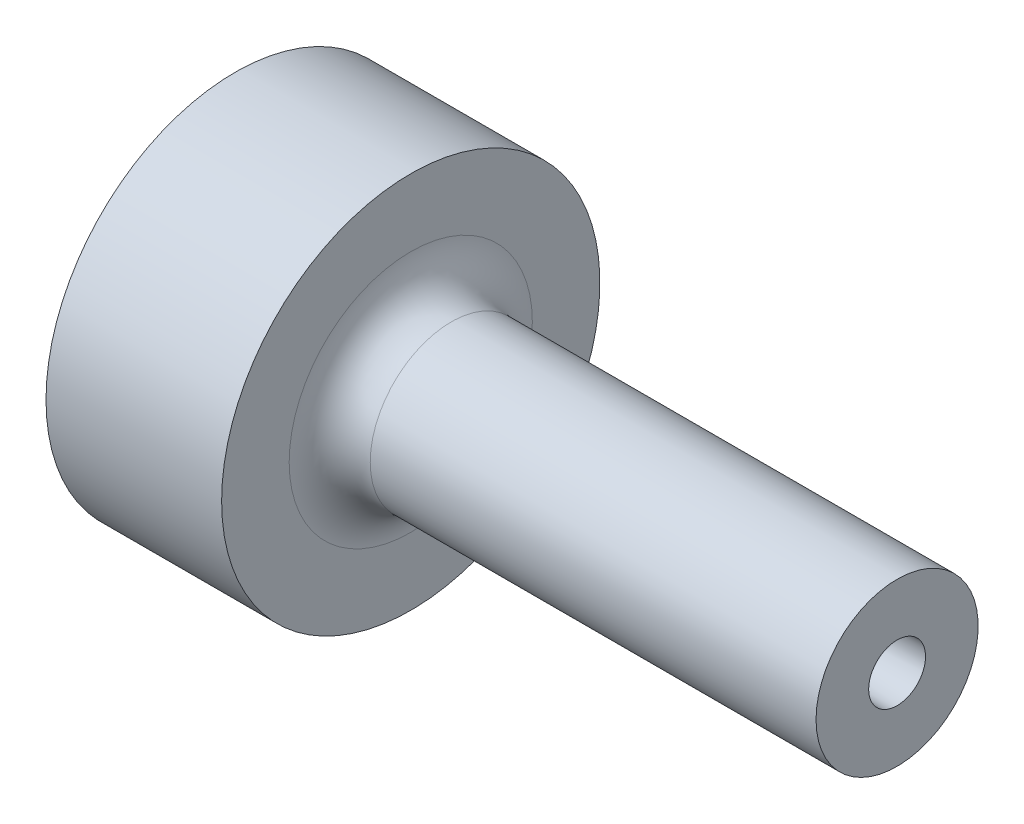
ISO-10303-21;
HEADER;
FILE_DESCRIPTION(('STEP AP214'),'2;1');
FILE_NAME('part.step','',(''),(''),'','','');
FILE_SCHEMA(('AUTOMOTIVE_DESIGN { 1 0 10303 214 1 1 1 1 }'));
ENDSEC;
DATA;
#1=APPLICATION_CONTEXT('core data for automotive mechanical design processes');
#2=APPLICATION_PROTOCOL_DEFINITION('international standard','automotive_design',2000,#1);
#3=PRODUCT_CONTEXT('',#1,'mechanical');
#4=PRODUCT('Part','Part','',(#3));
#5=PRODUCT_RELATED_PRODUCT_CATEGORY('part','',(#4));
#6=PRODUCT_DEFINITION_FORMATION('','',#4);
#7=PRODUCT_DEFINITION_CONTEXT('part definition',#1,'design');
#8=PRODUCT_DEFINITION('design','',#6,#7);
#9=PRODUCT_DEFINITION_SHAPE('','',#8);
#10=(LENGTH_UNIT() NAMED_UNIT(*) SI_UNIT(.MILLI.,.METRE.));
#11=(NAMED_UNIT(*) PLANE_ANGLE_UNIT() SI_UNIT($,.RADIAN.));
#12=(NAMED_UNIT(*) SI_UNIT($,.STERADIAN.) SOLID_ANGLE_UNIT());
#13=UNCERTAINTY_MEASURE_WITH_UNIT(LENGTH_MEASURE(1.E-05),#10,'distance_accuracy_value','');
#14=(GEOMETRIC_REPRESENTATION_CONTEXT(3) GLOBAL_UNCERTAINTY_ASSIGNED_CONTEXT((#13)) GLOBAL_UNIT_ASSIGNED_CONTEXT((#10,
#11,#12)) REPRESENTATION_CONTEXT('',''));
#15=CARTESIAN_POINT('',(0.,0.,0.));
#16=DIRECTION('',(0.,0.,1.));
#17=DIRECTION('',(1.,0.,0.));
#18=AXIS2_PLACEMENT_3D('',#15,#16,#17);
#19=CARTESIAN_POINT('',(0.,0.,0.));
#20=DIRECTION('',(-1.,0.,0.));
#21=DIRECTION('',(0.,0.,1.));
#22=AXIS2_PLACEMENT_3D('',#19,#20,#21);
#23=CYLINDRICAL_SURFACE('',#22,14.);
#24=CARTESIAN_POINT('',(13.,0.,0.));
#25=DIRECTION('',(-1.,0.,0.));
#26=DIRECTION('',(0.,0.,1.));
#27=AXIS2_PLACEMENT_3D('',#24,#25,#26);
#28=CIRCLE('',#27,14.);
#29=CARTESIAN_POINT('',(13.,0.,14.));
#30=VERTEX_POINT('',#29);
#31=EDGE_CURVE('E88',#30,#30,#28,.T.);
#32=ORIENTED_EDGE('',*,*,#31,.T.);
#33=EDGE_LOOP('',(#32));
#34=FACE_BOUND('',#33,.T.);
#35=CARTESIAN_POINT('',(0.,0.,0.));
#36=DIRECTION('',(-1.,0.,0.));
#37=DIRECTION('',(0.,0.,1.));
#38=AXIS2_PLACEMENT_3D('',#35,#36,#37);
#39=CIRCLE('',#38,14.);
#40=CARTESIAN_POINT('',(0.,0.,14.));
#41=VERTEX_POINT('',#40);
#42=EDGE_CURVE('E83',#41,#41,#39,.T.);
#43=ORIENTED_EDGE('',*,*,#42,.F.);
#44=EDGE_LOOP('',(#43));
#45=FACE_BOUND('',#44,.T.);
#46=CARTESIAN_POINT('',(6.5,-13.856406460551,-2.));
#47=CARTESIAN_POINT('',(6.61172417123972,-13.8564082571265,-1.99999534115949));
#48=CARTESIAN_POINT('',(6.72351471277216,-13.8577723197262,-1.99060664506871));
#49=CARTESIAN_POINT('',(6.9439746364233,-13.8630779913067,-1.95330740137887));
#50=CARTESIAN_POINT('',(7.05264079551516,-13.8670221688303,-1.92537839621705));
#51=CARTESIAN_POINT('',(7.26362870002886,-13.8770324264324,-1.85184738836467));
#52=CARTESIAN_POINT('',(7.36595507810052,-13.8830969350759,-1.80625847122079));
#53=CARTESIAN_POINT('',(7.56148972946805,-13.8966626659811,-1.69873175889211));
#54=CARTESIAN_POINT('',(7.65469934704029,-13.9041636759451,-1.63679637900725));
#55=CARTESIAN_POINT('',(7.83004829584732,-13.9198182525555,-1.49785346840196));
#56=CARTESIAN_POINT('',(7.91211171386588,-13.9279757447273,-1.42075056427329));
#57=CARTESIAN_POINT('',(8.06218155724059,-13.9439890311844,-1.25386707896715));
#58=CARTESIAN_POINT('',(8.13018723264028,-13.9518448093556,-1.16408582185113));
#59=CARTESIAN_POINT('',(8.25048909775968,-13.9664103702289,-0.973910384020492));
#60=CARTESIAN_POINT('',(8.30271571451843,-13.9731150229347,-0.873471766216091));
#61=CARTESIAN_POINT('',(8.38953073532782,-13.9845795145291,-0.665136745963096));
#62=CARTESIAN_POINT('',(8.4241199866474,-13.9893394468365,-0.557240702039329));
#63=CARTESIAN_POINT('',(8.47444920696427,-13.9963505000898,-0.337834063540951));
#64=CARTESIAN_POINT('',(8.49031606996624,-13.9986185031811,-0.226353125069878));
#65=CARTESIAN_POINT('',(8.5031438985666,-14.0004479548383,-0.00228956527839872));
#66=CARTESIAN_POINT('',(8.50010582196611,-14.0000095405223,0.110292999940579));
#67=CARTESIAN_POINT('',(8.47531062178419,-13.9964890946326,0.33249899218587));
#68=CARTESIAN_POINT('',(8.45369000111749,-13.9934263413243,0.442137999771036));
#69=CARTESIAN_POINT('',(8.39255744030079,-13.9850228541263,0.656215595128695));
#70=CARTESIAN_POINT('',(8.3530450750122,-13.9796820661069,0.760654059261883));
#71=CARTESIAN_POINT('',(8.25710925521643,-13.9672894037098,0.961781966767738));
#72=CARTESIAN_POINT('',(8.20062784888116,-13.9602316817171,1.05844339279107));
#73=CARTESIAN_POINT('',(8.07239950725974,-13.9451926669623,1.24096782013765));
#74=CARTESIAN_POINT('',(8.00065165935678,-13.9372113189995,1.32683017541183));
#75=CARTESIAN_POINT('',(7.843165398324,-13.921132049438,1.48612299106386));
#76=CARTESIAN_POINT('',(7.75730786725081,-13.9130337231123,1.55943569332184));
#77=CARTESIAN_POINT('',(7.57444547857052,-13.8977029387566,1.69062989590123));
#78=CARTESIAN_POINT('',(7.47744056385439,-13.890470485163,1.74851131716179));
#79=CARTESIAN_POINT('',(7.27491971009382,-13.8776905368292,1.84721301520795));
#80=CARTESIAN_POINT('',(7.1693981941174,-13.8721441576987,1.88802200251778));
#81=CARTESIAN_POINT('',(6.95290242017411,-13.8633846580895,1.9513062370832));
#82=CARTESIAN_POINT('',(6.84192850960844,-13.8601713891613,1.97378265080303));
#83=CARTESIAN_POINT('',(6.61872346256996,-13.8564698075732,1.99960390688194));
#84=CARTESIAN_POINT('',(6.50651197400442,-13.8559577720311,2.00311531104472));
#85=CARTESIAN_POINT('',(6.28310219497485,-13.8576537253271,1.9913480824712));
#86=CARTESIAN_POINT('',(6.17190387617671,-13.8598616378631,1.9760699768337));
#87=CARTESIAN_POINT('',(5.95418781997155,-13.8667269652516,1.92729837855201));
#88=CARTESIAN_POINT('',(5.84765127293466,-13.8713733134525,1.8938871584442));
#89=CARTESIAN_POINT('',(5.6416912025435,-13.8825829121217,1.80988306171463));
#90=CARTESIAN_POINT('',(5.54226800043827,-13.8891462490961,1.75928940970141));
#91=CARTESIAN_POINT('',(5.35260812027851,-13.9035064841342,1.64195360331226));
#92=CARTESIAN_POINT('',(5.26243903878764,-13.911311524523,1.57510320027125));
#93=CARTESIAN_POINT('',(5.09454027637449,-13.9272509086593,1.42730277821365));
#94=CARTESIAN_POINT('',(5.01681123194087,-13.9353852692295,1.34635203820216));
#95=CARTESIAN_POINT('',(4.8754047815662,-13.9511405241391,1.17191708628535));
#96=CARTESIAN_POINT('',(4.81183747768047,-13.9587570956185,1.07834317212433));
#97=CARTESIAN_POINT('',(4.70132443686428,-13.972552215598,0.881748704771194));
#98=CARTESIAN_POINT('',(4.65437828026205,-13.9787308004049,0.778728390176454));
#99=CARTESIAN_POINT('',(4.57861788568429,-13.9889347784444,0.566515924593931));
#100=CARTESIAN_POINT('',(4.54974241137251,-13.9929674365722,0.457345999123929));
#101=CARTESIAN_POINT('',(4.51074453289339,-13.9984555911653,0.235645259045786));
#102=CARTESIAN_POINT('',(4.50062101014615,-13.9999112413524,0.123114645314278));
#103=CARTESIAN_POINT('',(4.49943976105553,-14.0000800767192,-0.101043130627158));
#104=CARTESIAN_POINT('',(4.50821318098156,-13.998817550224,-0.212669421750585));
#105=CARTESIAN_POINT('',(4.54421615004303,-13.9937406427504,-0.432842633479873));
#106=CARTESIAN_POINT('',(4.57144565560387,-13.989926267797,-0.541389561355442));
#107=CARTESIAN_POINT('',(4.6435299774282,-13.9801722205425,-0.752283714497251));
#108=CARTESIAN_POINT('',(4.68837418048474,-13.9742338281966,-0.854634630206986));
#109=CARTESIAN_POINT('',(4.79439714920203,-13.960885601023,-1.05038570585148));
#110=CARTESIAN_POINT('',(4.8555763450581,-13.9534757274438,-1.14378562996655));
#111=CARTESIAN_POINT('',(4.99314771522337,-13.9379304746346,-1.31984194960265));
#112=CARTESIAN_POINT('',(5.06966490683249,-13.9297894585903,-1.40240016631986));
#113=CARTESIAN_POINT('',(5.2354775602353,-13.9137422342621,-1.55356716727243));
#114=CARTESIAN_POINT('',(5.32477602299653,-13.9058360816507,-1.6221726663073));
#115=CARTESIAN_POINT('',(5.51414543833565,-13.8911108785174,-1.74379523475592));
#116=CARTESIAN_POINT('',(5.61426869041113,-13.8842975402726,-1.79673154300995));
#117=CARTESIAN_POINT('',(5.82203229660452,-13.8725962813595,-1.88495902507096));
#118=CARTESIAN_POINT('',(5.92966459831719,-13.8677063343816,-1.92026877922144));
#119=CARTESIAN_POINT('',(6.11483642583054,-13.8615529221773,-1.96409255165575));
#120=CARTESIAN_POINT('',(6.19122433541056,-13.859633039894,-1.97753762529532));
#121=CARTESIAN_POINT('',(6.34506419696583,-13.857059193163,-1.99549291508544));
#122=CARTESIAN_POINT('',(6.42251613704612,-13.8564052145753,-2.00000323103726));
#123=CARTESIAN_POINT('',(6.5,-13.856406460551,-2.));
#124=B_SPLINE_CURVE_WITH_KNOTS('',3,(#46,#47,#48,#49,#50,#51,#52,#53,#54,#55,#56,#57,#58,#59,
#60,#61,#62,#63,#64,#65,#66,#67,#68,#69,#70,#71,#72,#73,#74,#75,#76,#77,#78,#79,#80,#81,#82,#83,
#84,#85,#86,#87,#88,#89,#90,#91,#92,#93,#94,#95,#96,#97,#98,#99,#100,#101,#102,#103,#104,#105,
#106,#107,#108,#109,#110,#111,#112,#113,#114,#115,#116,#117,#118,#119,#120,#121,#122,#123),
.UNSPECIFIED.,.T.,.F.,(4,2,2,2,2,2,2,2,2,2,2,2,2,2,2,2,2,2,2,2,2,2,2,2,2,2,2,2,2,2,2,2,2,2,2,2,
2,2,4),(0.,0.334889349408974,0.670112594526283,1.00508792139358,1.34001378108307,
1.6771171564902,2.01423851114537,2.35282530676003,2.6913958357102,3.02765822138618,
3.36390357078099,3.69769984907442,4.03150405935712,4.36646147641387,4.70143892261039,
5.03940517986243,5.37737316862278,5.7155642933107,6.05373389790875,6.3889286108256,
6.72411392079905,7.05779100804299,7.39148315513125,7.72746121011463,8.06345644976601,
8.40197921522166,8.74049343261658,9.07785422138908,9.41519488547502,9.74953375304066,
10.083871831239,10.4180087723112,10.7521545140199,11.0891434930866,11.426211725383,
11.7649881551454,12.103406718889,12.3356645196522,12.5679197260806),.UNSPECIFIED.);
#125=CARTESIAN_POINT('',(6.5,-13.856406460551,-2.));
#126=VERTEX_POINT('',#125);
#127=EDGE_CURVE('E9',#126,#126,#124,.T.);
#128=ORIENTED_EDGE('',*,*,#127,.F.);
#129=EDGE_LOOP('',(#128));
#130=FACE_BOUND('',#129,.T.);
#131=ADVANCED_FACE('F15',(#34,#45,#130),#23,.T.);
#132=CARTESIAN_POINT('',(0.,0.,0.));
#133=DIRECTION('',(1.,0.,0.));
#134=DIRECTION('',(0.,0.,-1.));
#135=AXIS2_PLACEMENT_3D('',#132,#133,#134);
#136=CONICAL_SURFACE('',#135,1.25,0.0174532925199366);
#137=CARTESIAN_POINT('',(49.,0.,0.));
#138=DIRECTION('',(-1.,0.,0.));
#139=DIRECTION('',(0.,0.,1.));
#140=AXIS2_PLACEMENT_3D('',#137,#138,#139);
#141=CIRCLE('',#140,2.10529818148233);
#142=CARTESIAN_POINT('',(49.,0.,2.10529818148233));
#143=VERTEX_POINT('',#142);
#144=EDGE_CURVE('E80',#143,#143,#141,.T.);
#145=ORIENTED_EDGE('',*,*,#144,.F.);
#146=EDGE_LOOP('',(#145));
#147=FACE_BOUND('',#146,.T.);
#148=CARTESIAN_POINT('',(1.22738614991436,0.,0.));
#149=DIRECTION('',(-1.,0.,0.));
#150=DIRECTION('',(0.,0.,1.));
#151=AXIS2_PLACEMENT_3D('',#148,#149,#150);
#152=CIRCLE('',#151,1.27142410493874);
#153=CARTESIAN_POINT('',(1.22738614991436,0.,1.27142410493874));
#154=VERTEX_POINT('',#153);
#155=EDGE_CURVE('E93',#154,#154,#152,.F.);
#156=ORIENTED_EDGE('',*,*,#155,.F.);
#157=EDGE_LOOP('',(#156));
#158=FACE_BOUND('',#157,.T.);
#159=ADVANCED_FACE('F44',(#147,#158),#136,.F.);
#160=CARTESIAN_POINT('',(16.,0.,0.));
#161=DIRECTION('',(-1.,0.,0.));
#162=DIRECTION('',(0.,0.,1.));
#163=AXIS2_PLACEMENT_3D('',#160,#161,#162);
#164=TOROIDAL_SURFACE('',#163,9.,3.);
#165=CARTESIAN_POINT('',(13.,0.,0.));
#166=DIRECTION('',(-1.,0.,0.));
#167=DIRECTION('',(0.,0.,1.));
#168=AXIS2_PLACEMENT_3D('',#165,#166,#167);
#169=CIRCLE('',#168,9.);
#170=CARTESIAN_POINT('',(13.,0.,9.));
#171=VERTEX_POINT('',#170);
#172=EDGE_CURVE('E90',#171,#171,#169,.T.);
#173=ORIENTED_EDGE('',*,*,#172,.F.);
#174=EDGE_LOOP('',(#173));
#175=FACE_BOUND('',#174,.T.);
#176=CARTESIAN_POINT('',(16.,0.,0.));
#177=DIRECTION('',(-1.,0.,0.));
#178=DIRECTION('',(0.,0.,1.));
#179=AXIS2_PLACEMENT_3D('',#176,#177,#178);
#180=CIRCLE('',#179,6.);
#181=CARTESIAN_POINT('',(16.,0.,6.));
#182=VERTEX_POINT('',#181);
#183=EDGE_CURVE('E27',#182,#182,#180,.T.);
#184=ORIENTED_EDGE('',*,*,#183,.T.);
#185=EDGE_LOOP('',(#184));
#186=FACE_BOUND('',#185,.T.);
#187=ADVANCED_FACE('F17',(#175,#186),#164,.F.);
#188=CARTESIAN_POINT('',(0.,0.,0.));
#189=DIRECTION('',(-1.,0.,0.));
#190=DIRECTION('',(0.,0.,1.));
#191=AXIS2_PLACEMENT_3D('',#188,#189,#190);
#192=CYLINDRICAL_SURFACE('',#191,6.);
#193=ORIENTED_EDGE('',*,*,#183,.F.);
#194=EDGE_LOOP('',(#193));
#195=FACE_BOUND('',#194,.T.);
#196=CARTESIAN_POINT('',(49.,0.,0.));
#197=DIRECTION('',(-1.,0.,0.));
#198=DIRECTION('',(0.,0.,1.));
#199=AXIS2_PLACEMENT_3D('',#196,#197,#198);
#200=CIRCLE('',#199,6.);
#201=CARTESIAN_POINT('',(49.,0.,6.));
#202=VERTEX_POINT('',#201);
#203=EDGE_CURVE('E79',#202,#202,#200,.T.);
#204=ORIENTED_EDGE('',*,*,#203,.T.);
#205=EDGE_LOOP('',(#204));
#206=FACE_BOUND('',#205,.T.);
#207=ADVANCED_FACE('F65',(#195,#206),#192,.T.);
#208=CARTESIAN_POINT('',(49.,6.,0.));
#209=DIRECTION('',(-1.,0.,0.));
#210=DIRECTION('',(0.,0.,1.));
#211=AXIS2_PLACEMENT_3D('',#208,#209,#210);
#212=PLANE('',#211);
#213=ORIENTED_EDGE('',*,*,#203,.F.);
#214=EDGE_LOOP('',(#213));
#215=FACE_BOUND('',#214,.T.);
#216=ORIENTED_EDGE('',*,*,#144,.T.);
#217=EDGE_LOOP('',(#216));
#218=FACE_BOUND('',#217,.T.);
#219=ADVANCED_FACE('F61',(#215,#218),#212,.F.);
#220=CARTESIAN_POINT('',(0.,1.25,0.));
#221=DIRECTION('',(1.,0.,0.));
#222=DIRECTION('',(0.,0.,-1.));
#223=AXIS2_PLACEMENT_3D('',#220,#221,#222);
#224=PLANE('',#223);
#225=CARTESIAN_POINT('',(0.,0.,0.));
#226=DIRECTION('',(-1.,0.,0.));
#227=DIRECTION('',(0.,0.,1.));
#228=AXIS2_PLACEMENT_3D('',#225,#226,#227);
#229=CIRCLE('',#228,5.);
#230=CARTESIAN_POINT('',(0.,0.,5.));
#231=VERTEX_POINT('',#230);
#232=EDGE_CURVE('E96',#231,#231,#229,.T.);
#233=ORIENTED_EDGE('',*,*,#232,.F.);
#234=EDGE_LOOP('',(#233));
#235=FACE_BOUND('',#234,.T.);
#236=ORIENTED_EDGE('',*,*,#42,.T.);
#237=EDGE_LOOP('',(#236));
#238=FACE_BOUND('',#237,.T.);
#239=ADVANCED_FACE('F59',(#235,#238),#224,.F.);
#240=CARTESIAN_POINT('',(13.,14.,0.));
#241=DIRECTION('',(-1.,0.,0.));
#242=DIRECTION('',(0.,0.,1.));
#243=AXIS2_PLACEMENT_3D('',#240,#241,#242);
#244=PLANE('',#243);
#245=ORIENTED_EDGE('',*,*,#31,.F.);
#246=EDGE_LOOP('',(#245));
#247=FACE_BOUND('',#246,.T.);
#248=ORIENTED_EDGE('',*,*,#172,.T.);
#249=EDGE_LOOP('',(#248));
#250=FACE_BOUND('',#249,.T.);
#251=ADVANCED_FACE('F57',(#247,#250),#244,.F.);
#252=CARTESIAN_POINT('',(-37.3349076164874,0.,0.));
#253=DIRECTION('',(-1.,0.,0.));
#254=DIRECTION('',(0.,0.,1.));
#255=AXIS2_PLACEMENT_3D('',#252,#253,#254);
#256=DEGENERATE_TOROIDAL_SURFACE('',#255,9.35634609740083,40.,.F.);
#257=ORIENTED_EDGE('',*,*,#232,.T.);
#258=EDGE_LOOP('',(#257));
#259=FACE_BOUND('',#258,.T.);
#260=ORIENTED_EDGE('',*,*,#155,.T.);
#261=EDGE_LOOP('',(#260));
#262=FACE_BOUND('',#261,.T.);
#263=ADVANCED_FACE('F40',(#259,#262),#256,.T.);
#264=CARTESIAN_POINT('',(6.5,-14.,0.));
#265=DIRECTION('',(0.,-1.,0.));
#266=DIRECTION('',(0.,0.,-1.));
#267=AXIS2_PLACEMENT_3D('',#264,#265,#266);
#268=CYLINDRICAL_SURFACE('',#267,2.);
#269=CARTESIAN_POINT('',(6.5,-8.,0.));
#270=DIRECTION('',(0.,-1.,0.));
#271=DIRECTION('',(0.,0.,-1.));
#272=AXIS2_PLACEMENT_3D('',#269,#270,#271);
#273=CIRCLE('',#272,2.);
#274=CARTESIAN_POINT('',(6.5,-8.,-2.));
#275=VERTEX_POINT('',#274);
#276=EDGE_CURVE('E99',#275,#275,#273,.T.);
#277=ORIENTED_EDGE('',*,*,#276,.F.);
#278=EDGE_LOOP('',(#277));
#279=FACE_BOUND('',#278,.T.);
#280=ORIENTED_EDGE('',*,*,#127,.T.);
#281=EDGE_LOOP('',(#280));
#282=FACE_BOUND('',#281,.T.);
#283=ADVANCED_FACE('F32',(#279,#282),#268,.F.);
#284=CARTESIAN_POINT('',(6.5,-6.84529946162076,0.));
#285=DIRECTION('',(0.,-1.,0.));
#286=DIRECTION('',(0.,0.,-1.));
#287=AXIS2_PLACEMENT_3D('',#284,#285,#286);
#288=CONICAL_SURFACE('',#287,0.,1.0471975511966);
#289=ORIENTED_EDGE('',*,*,#276,.T.);
#290=EDGE_LOOP('',(#289));
#291=FACE_BOUND('',#290,.T.);
#292=CARTESIAN_POINT('',(6.5,-6.84529946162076,0.));
#293=VERTEX_POINT('',#292);
#294=VERTEX_LOOP('',#293);
#295=FACE_BOUND('',#294,.T.);
#296=ADVANCED_FACE('F30',(#291,#295),#288,.F.);
#297=CLOSED_SHELL('',(#131,#159,#187,#207,#219,#239,#251,#263,#283,#296));
#298=MANIFOLD_SOLID_BREP('B1',#297);
#299=ADVANCED_BREP_SHAPE_REPRESENTATION('',(#18,#298),#14);
#300=SHAPE_DEFINITION_REPRESENTATION(#9,#299);
ENDSEC;
END-ISO-10303-21;
